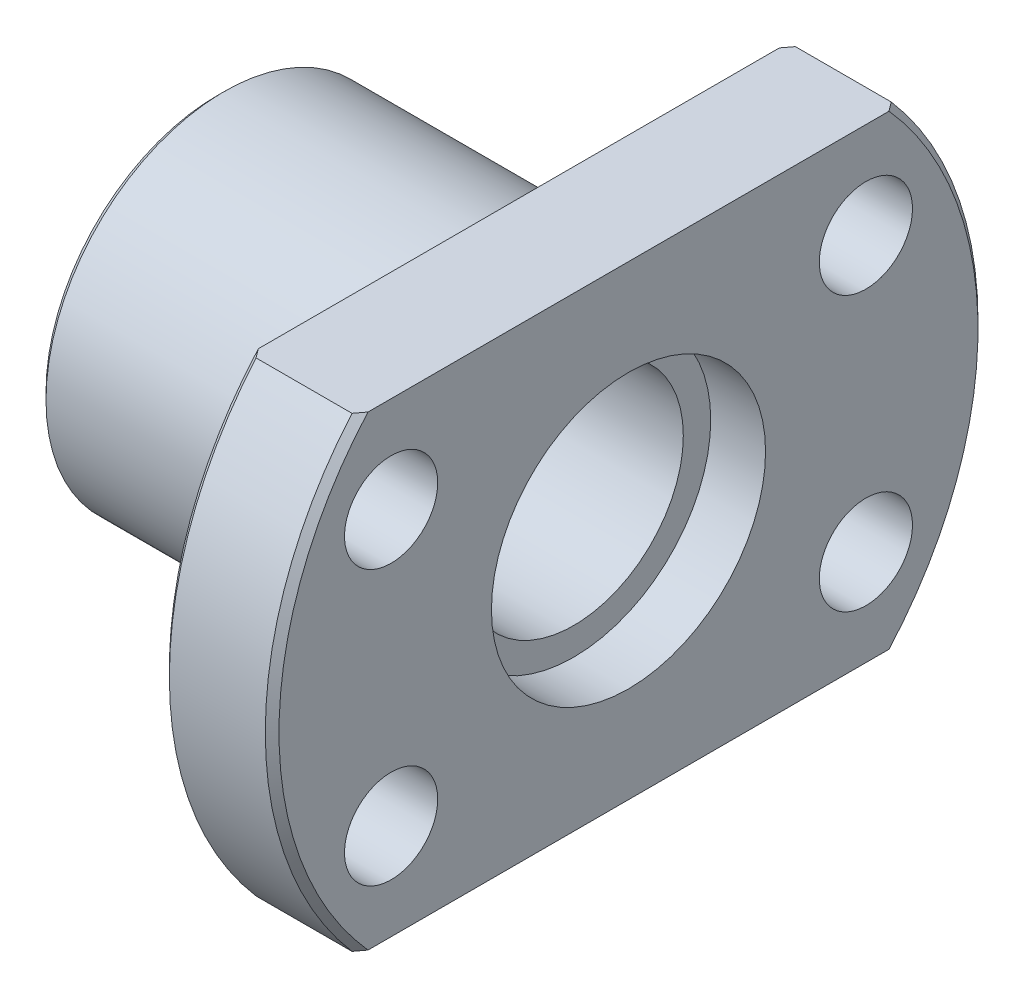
ISO-10303-21;
HEADER;
FILE_DESCRIPTION(('STEP AP214'),'2;1');
FILE_NAME('part.step','',(''),(''),'','','');
FILE_SCHEMA(('AUTOMOTIVE_DESIGN { 1 0 10303 214 1 1 1 1 }'));
ENDSEC;
DATA;
#1=APPLICATION_CONTEXT('core data for automotive mechanical design processes');
#2=APPLICATION_PROTOCOL_DEFINITION('international standard','automotive_design',2000,#1);
#3=PRODUCT_CONTEXT('',#1,'mechanical');
#4=PRODUCT('Part','Part','',(#3));
#5=PRODUCT_RELATED_PRODUCT_CATEGORY('part','',(#4));
#6=PRODUCT_DEFINITION_FORMATION('','',#4);
#7=PRODUCT_DEFINITION_CONTEXT('part definition',#1,'design');
#8=PRODUCT_DEFINITION('design','',#6,#7);
#9=PRODUCT_DEFINITION_SHAPE('','',#8);
#10=(LENGTH_UNIT() NAMED_UNIT(*) SI_UNIT(.MILLI.,.METRE.));
#11=(NAMED_UNIT(*) PLANE_ANGLE_UNIT() SI_UNIT($,.RADIAN.));
#12=(NAMED_UNIT(*) SI_UNIT($,.STERADIAN.) SOLID_ANGLE_UNIT());
#13=UNCERTAINTY_MEASURE_WITH_UNIT(LENGTH_MEASURE(1.E-05),#10,'distance_accuracy_value','');
#14=(GEOMETRIC_REPRESENTATION_CONTEXT(3) GLOBAL_UNCERTAINTY_ASSIGNED_CONTEXT((#13)) GLOBAL_UNIT_ASSIGNED_CONTEXT((#10,
#11,#12)) REPRESENTATION_CONTEXT('',''));
#15=CARTESIAN_POINT('',(0.,0.,0.));
#16=DIRECTION('',(0.,0.,1.));
#17=DIRECTION('',(1.,0.,0.));
#18=AXIS2_PLACEMENT_3D('',#15,#16,#17);
#19=CARTESIAN_POINT('',(11.,12.75,0.));
#20=DIRECTION('',(1.,0.,0.));
#21=DIRECTION('',(0.,0.,-1.));
#22=AXIS2_PLACEMENT_3D('',#19,#20,#21);
#23=PLANE('',#22);
#24=CARTESIAN_POINT('',(11.,5.00000000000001,8.6602540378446));
#25=DIRECTION('',(1.,0.,0.));
#26=DIRECTION('',(0.,0.,-1.));
#27=AXIS2_PLACEMENT_3D('',#24,#25,#26);
#28=CIRCLE('',#27,1.7);
#29=CARTESIAN_POINT('',(11.,5.00000000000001,6.9602540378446));
#30=VERTEX_POINT('',#29);
#31=EDGE_CURVE('E492',#30,#30,#28,.T.);
#32=ORIENTED_EDGE('',*,*,#31,.T.);
#33=EDGE_LOOP('',(#32));
#34=FACE_BOUND('',#33,.T.);
#35=CARTESIAN_POINT('',(11.,-5.00000000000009,8.66025403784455));
#36=DIRECTION('',(1.,0.,0.));
#37=DIRECTION('',(0.,0.,-1.));
#38=AXIS2_PLACEMENT_3D('',#35,#36,#37);
#39=CIRCLE('',#38,1.7);
#40=CARTESIAN_POINT('',(11.,-5.00000000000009,6.96025403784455));
#41=VERTEX_POINT('',#40);
#42=EDGE_CURVE('E488',#41,#41,#39,.T.);
#43=ORIENTED_EDGE('',*,*,#42,.T.);
#44=EDGE_LOOP('',(#43));
#45=FACE_BOUND('',#44,.T.);
#46=CARTESIAN_POINT('',(11.,-5.,-8.6602540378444));
#47=DIRECTION('',(1.,0.,0.));
#48=DIRECTION('',(0.,0.,-1.));
#49=AXIS2_PLACEMENT_3D('',#46,#47,#48);
#50=CIRCLE('',#49,1.7);
#51=CARTESIAN_POINT('',(11.,-5.,-10.3602540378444));
#52=VERTEX_POINT('',#51);
#53=EDGE_CURVE('E480',#52,#52,#50,.T.);
#54=ORIENTED_EDGE('',*,*,#53,.T.);
#55=EDGE_LOOP('',(#54));
#56=FACE_BOUND('',#55,.T.);
#57=CARTESIAN_POINT('',(11.,5.,-8.6602540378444));
#58=DIRECTION('',(1.,0.,0.));
#59=DIRECTION('',(0.,0.,-1.));
#60=AXIS2_PLACEMENT_3D('',#57,#58,#59);
#61=CIRCLE('',#60,1.7);
#62=CARTESIAN_POINT('',(11.,5.,-10.3602540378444));
#63=VERTEX_POINT('',#62);
#64=EDGE_CURVE('E174',#63,#63,#61,.T.);
#65=ORIENTED_EDGE('',*,*,#64,.T.);
#66=EDGE_LOOP('',(#65));
#67=FACE_BOUND('',#66,.T.);
#68=CARTESIAN_POINT('',(11.,0.,0.));
#69=DIRECTION('',(-1.,0.,0.));
#70=DIRECTION('',(0.,0.,1.));
#71=AXIS2_PLACEMENT_3D('',#68,#69,#70);
#72=CIRCLE('',#71,6.);
#73=CARTESIAN_POINT('',(11.,0.,6.));
#74=VERTEX_POINT('',#73);
#75=EDGE_CURVE('E131',#74,#74,#72,.T.);
#76=ORIENTED_EDGE('',*,*,#75,.F.);
#77=EDGE_LOOP('',(#76));
#78=FACE_BOUND('',#77,.T.);
#79=DIRECTION('',(0.,0.,1.));
#80=VECTOR('',#79,1.);
#81=CARTESIAN_POINT('',(11.,8.5,-13.1));
#82=LINE('',#81,#80);
#83=CARTESIAN_POINT('',(11.,8.5,-9.50328890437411));
#84=VERTEX_POINT('',#83);
#85=CARTESIAN_POINT('',(11.,8.5,9.5032889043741));
#86=VERTEX_POINT('',#85);
#87=EDGE_CURVE('E169',#84,#86,#82,.T.);
#88=ORIENTED_EDGE('',*,*,#87,.F.);
#89=CARTESIAN_POINT('',(11.,0.,0.));
#90=DIRECTION('',(-1.,0.,0.));
#91=DIRECTION('',(0.,0.,1.));
#92=AXIS2_PLACEMENT_3D('',#89,#90,#91);
#93=CIRCLE('',#92,12.75);
#94=CARTESIAN_POINT('',(11.,-8.5,-9.5032889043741));
#95=VERTEX_POINT('',#94);
#96=EDGE_CURVE('E130',#84,#95,#93,.T.);
#97=ORIENTED_EDGE('',*,*,#96,.T.);
#98=DIRECTION('',(0.,0.,-1.));
#99=VECTOR('',#98,1.);
#100=CARTESIAN_POINT('',(11.,-8.5,13.1));
#101=LINE('',#100,#99);
#102=CARTESIAN_POINT('',(11.,-8.5,9.50328890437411));
#103=VERTEX_POINT('',#102);
#104=EDGE_CURVE('E110',#103,#95,#101,.T.);
#105=ORIENTED_EDGE('',*,*,#104,.F.);
#106=EDGE_CURVE('E127',#103,#86,#93,.T.);
#107=ORIENTED_EDGE('',*,*,#106,.T.);
#108=EDGE_LOOP('',(#88,#97,#105,#107));
#109=FACE_BOUND('',#108,.T.);
#110=ADVANCED_FACE('F32',(#34,#45,#56,#67,#78,#109),#23,.F.);
#111=CARTESIAN_POINT('',(11.25,0.,0.));
#112=DIRECTION('',(1.,0.,0.));
#113=DIRECTION('',(0.,0.,-1.));
#114=AXIS2_PLACEMENT_3D('',#111,#112,#113);
#115=CONICAL_SURFACE('',#114,13.,0.785398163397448);
#116=CARTESIAN_POINT('',(26.8509211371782,8.5,-27.3086559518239));
#117=CARTESIAN_POINT('',(26.3806792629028,8.5,-26.8161444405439));
#118=CARTESIAN_POINT('',(25.9110077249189,8.5,-26.3230870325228));
#119=CARTESIAN_POINT('',(24.9730470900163,8.5,-25.3356529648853));
#120=CARTESIAN_POINT('',(24.5047580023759,8.5,-24.8412762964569));
#121=CARTESIAN_POINT('',(23.5696803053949,8.5,-23.8508451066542));
#122=CARTESIAN_POINT('',(23.1028921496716,8.5,-23.3547901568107));
#123=CARTESIAN_POINT('',(22.171274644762,8.5,-22.3608455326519));
#124=CARTESIAN_POINT('',(21.706445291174,8.5,-21.862955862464));
#125=CARTESIAN_POINT('',(20.7753991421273,8.5,-20.8609252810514));
#126=CARTESIAN_POINT('',(20.3092016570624,8.5,-20.3567664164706));
#127=CARTESIAN_POINT('',(19.3797732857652,8.5,-19.345721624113));
#128=CARTESIAN_POINT('',(18.9165423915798,8.5,-18.8388357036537));
#129=CARTESIAN_POINT('',(17.9938558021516,8.5,-17.8217737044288));
#130=CARTESIAN_POINT('',(17.53439955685,8.5,-17.3115981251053));
#131=CARTESIAN_POINT('',(16.6201982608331,8.5,-16.287043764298));
#132=CARTESIAN_POINT('',(16.1654531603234,8.5,-15.7726650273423));
#133=CARTESIAN_POINT('',(15.4399320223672,8.5,-14.9421199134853));
#134=CARTESIAN_POINT('',(15.1672153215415,8.5,-14.6276489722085));
#135=CARTESIAN_POINT('',(14.6244674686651,8.5,-13.9963993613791));
#136=CARTESIAN_POINT('',(14.3544362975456,8.5,-13.6796207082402));
#137=CARTESIAN_POINT('',(13.8175130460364,8.5,-13.0432604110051));
#138=CARTESIAN_POINT('',(13.5506218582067,8.5,-12.723678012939));
#139=CARTESIAN_POINT('',(13.0207389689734,8.5,-12.0812961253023));
#140=CARTESIAN_POINT('',(12.7577472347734,8.5,-11.758496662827));
#141=CARTESIAN_POINT('',(12.2370461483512,8.5,-11.1096744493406));
#142=CARTESIAN_POINT('',(11.97932763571,8.5,-10.7836590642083));
#143=CARTESIAN_POINT('',(11.4698057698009,8.5,-10.1270030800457));
#144=CARTESIAN_POINT('',(11.2180026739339,8.5,-9.79636228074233));
#145=CARTESIAN_POINT('',(10.7219968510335,8.5,-9.12964035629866));
#146=CARTESIAN_POINT('',(10.4777907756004,8.5,-8.79356173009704));
#147=CARTESIAN_POINT('',(9.99901158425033,8.5,-8.11463307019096));
#148=CARTESIAN_POINT('',(9.76443731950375,8.5,-7.77178385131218));
#149=CARTESIAN_POINT('',(9.34298572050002,8.5,-7.13114235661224));
#150=CARTESIAN_POINT('',(9.1543212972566,8.5,-6.83453017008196));
#151=CARTESIAN_POINT('',(8.78845116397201,8.5,-6.2342299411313));
#152=CARTESIAN_POINT('',(8.61124667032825,8.5,-5.93054115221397));
#153=CARTESIAN_POINT('',(8.27150637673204,8.5,-5.31475216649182));
#154=CARTESIAN_POINT('',(8.10897997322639,8.5,-5.00264674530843));
#155=CARTESIAN_POINT('',(7.80312610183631,8.5,-4.3691120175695));
#156=CARTESIAN_POINT('',(7.65979458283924,8.5,-4.04768469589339));
#157=CARTESIAN_POINT('',(7.42577714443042,8.5,-3.46414265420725));
#158=CARTESIAN_POINT('',(7.33037555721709,8.5,-3.20393104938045));
#159=CARTESIAN_POINT('',(7.1582443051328,8.5,-2.67743312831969));
#160=CARTESIAN_POINT('',(7.08150741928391,8.5,-2.41114920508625));
#161=CARTESIAN_POINT('',(6.9503059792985,8.5,-1.87423092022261));
#162=CARTESIAN_POINT('',(6.89575117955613,8.5,-1.60361893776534));
#163=CARTESIAN_POINT('',(6.8114280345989,8.5,-1.05852616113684));
#164=CARTESIAN_POINT('',(6.78165676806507,8.5,-0.78404582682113));
#165=CARTESIAN_POINT('',(6.74862071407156,8.5,-0.231018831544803));
#166=CARTESIAN_POINT('',(6.74559318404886,8.5,0.0475423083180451));
#167=CARTESIAN_POINT('',(6.76687244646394,8.5,0.603600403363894));
#168=CARTESIAN_POINT('',(6.79117973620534,8.5,0.881097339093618));
#169=CARTESIAN_POINT('',(6.86565657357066,8.5,1.43342924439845));
#170=CARTESIAN_POINT('',(6.91590714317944,8.5,1.70825311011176));
#171=CARTESIAN_POINT('',(7.03942590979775,8.5,2.25263719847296));
#172=CARTESIAN_POINT('',(7.11269950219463,8.5,2.52219617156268));
#173=CARTESIAN_POINT('',(7.32273745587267,8.5,3.19601127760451));
#174=CARTESIAN_POINT('',(7.47259310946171,8.5,3.59619208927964));
#175=CARTESIAN_POINT('',(7.72288719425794,8.5,4.18535880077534));
#176=CARTESIAN_POINT('',(7.8106194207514,8.5,4.37998930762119));
#177=CARTESIAN_POINT('',(7.99340153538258,8.5,4.76578704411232));
#178=CARTESIAN_POINT('',(8.08845080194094,8.5,4.95695456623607));
#179=CARTESIAN_POINT('',(8.28588531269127,8.5,5.33815297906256));
#180=CARTESIAN_POINT('',(8.38834064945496,8.5,5.52814731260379));
#181=CARTESIAN_POINT('',(8.59870227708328,8.5,5.90509054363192));
#182=CARTESIAN_POINT('',(8.70660864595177,8.5,6.09203939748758));
#183=CARTESIAN_POINT('',(8.92703619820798,8.5,6.46307686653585));
#184=CARTESIAN_POINT('',(9.03955532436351,8.5,6.64716670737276));
#185=CARTESIAN_POINT('',(9.26859196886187,8.5,7.01282188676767));
#186=CARTESIAN_POINT('',(9.38510926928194,8.5,7.19438736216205));
#187=CARTESIAN_POINT('',(9.66412984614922,8.5,7.62015294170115));
#188=CARTESIAN_POINT('',(9.82809921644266,8.5,7.86339179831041));
#189=CARTESIAN_POINT('',(10.1613073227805,8.5,8.3462417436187));
#190=CARTESIAN_POINT('',(10.3305463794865,8.5,8.58585261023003));
#191=CARTESIAN_POINT('',(10.6734460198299,8.5,9.06197001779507));
#192=CARTESIAN_POINT('',(10.8471076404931,8.5,9.29847581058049));
#193=CARTESIAN_POINT('',(11.1981194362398,8.5,9.7687375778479));
#194=CARTESIAN_POINT('',(11.3754697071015,8.5,10.0024934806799));
#195=CARTESIAN_POINT('',(11.9125167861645,8.5,10.7006149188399));
#196=CARTESIAN_POINT('',(12.2768851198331,8.5,11.1613878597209));
#197=CARTESIAN_POINT('',(13.0146617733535,8.5,12.0755046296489));
#198=CARTESIAN_POINT('',(13.3880690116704,8.5,12.5288493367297));
#199=CARTESIAN_POINT('',(14.1432170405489,8.5,13.4315188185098));
#200=CARTESIAN_POINT('',(14.5249844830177,8.5,13.880821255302));
#201=CARTESIAN_POINT('',(15.2938746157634,8.5,14.7748303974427));
#202=CARTESIAN_POINT('',(15.6809974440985,8.5,15.2195369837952));
#203=CARTESIAN_POINT('',(16.4592387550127,8.5,16.10499711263));
#204=CARTESIAN_POINT('',(16.8503548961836,8.5,16.5457527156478));
#205=CARTESIAN_POINT('',(17.6359605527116,8.5,17.4242364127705));
#206=CARTESIAN_POINT('',(18.0304500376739,8.5,17.8619645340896));
#207=CARTESIAN_POINT('',(19.1193520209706,8.5,19.0626321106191));
#208=CARTESIAN_POINT('',(19.81658812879,8.5,19.8230100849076));
#209=CARTESIAN_POINT('',(21.2171729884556,8.5,21.3383295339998));
#210=CARTESIAN_POINT('',(21.9205227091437,8.5,22.0932701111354));
#211=CARTESIAN_POINT('',(23.3265654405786,8.5,23.5934742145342));
#212=CARTESIAN_POINT('',(24.0292259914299,8.5,24.3387681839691));
#213=CARTESIAN_POINT('',(25.0856849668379,8.5,25.4542361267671));
#214=CARTESIAN_POINT('',(25.438216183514,8.5,25.8256119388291));
#215=CARTESIAN_POINT('',(26.1440290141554,8.5,26.5676484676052));
#216=CARTESIAN_POINT('',(26.4973106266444,8.5,26.9383091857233));
#217=CARTESIAN_POINT('',(26.8509211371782,8.5,27.3086559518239));
#218=B_SPLINE_CURVE_WITH_KNOTS('',3,(#116,#117,#118,#119,#120,#121,#122,#123,#124,#125,#126,
#127,#128,#129,#130,#131,#132,#133,#134,#135,#136,#137,#138,#139,#140,#141,#142,#143,#144,#145,
#146,#147,#148,#149,#150,#151,#152,#153,#154,#155,#156,#157,#158,#159,#160,#161,#162,#163,#164,
#165,#166,#167,#168,#169,#170,#171,#172,#173,#174,#175,#176,#177,#178,#179,#180,#181,#182,#183,
#184,#185,#186,#187,#188,#189,#190,#191,#192,#193,#194,#195,#196,#197,#198,#199,#200,#201,#202,
#203,#204,#205,#206,#207,#208,#209,#210,#211,#212,#213,#214,#215,#216,#217),.UNSPECIFIED.,.F.,
.F.,(4,2,2,2,2,2,2,2,2,2,2,2,2,2,2,2,2,2,2,2,2,2,2,2,2,2,2,2,2,2,2,2,2,2,2,2,2,2,2,2,2,2,2,2,2,
2,2,2,2,2,4),(0.,2.04285563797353,4.08572495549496,6.12916253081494,8.1725955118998,
10.2325973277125,12.2925936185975,14.3522841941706,16.4119529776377,17.6606993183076,
18.9094367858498,20.1585210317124,21.40759476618,22.6542738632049,23.9010071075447,
25.1471828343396,26.3932094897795,27.4475984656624,28.5020991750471,29.5572702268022,
30.6122182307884,31.443090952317,32.2736417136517,33.1007788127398,33.9278184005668,
34.7621877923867,35.5965723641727,36.4335786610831,37.2707812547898,38.5502873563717,
39.1906663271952,39.8309909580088,40.4784691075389,41.1259565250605,41.7731582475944,
42.4203247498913,43.30026980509,44.1802685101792,45.0604754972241,45.9407053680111,
47.7028203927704,49.4647256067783,51.233447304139,53.0022146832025,54.7699985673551,
56.5377665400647,59.6326816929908,62.7280965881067,65.800988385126,67.3371465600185,
68.8733017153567),.UNSPECIFIED.);
#219=CARTESIAN_POINT('',(11.25,8.5,-9.836157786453));
#220=VERTEX_POINT('',#219);
#221=EDGE_CURVE('E180',#220,#84,#218,.T.);
#222=ORIENTED_EDGE('',*,*,#221,.F.);
#223=CARTESIAN_POINT('',(11.25,0.,0.));
#224=DIRECTION('',(-1.,0.,0.));
#225=DIRECTION('',(0.,0.,1.));
#226=AXIS2_PLACEMENT_3D('',#223,#224,#225);
#227=CIRCLE('',#226,13.);
#228=CARTESIAN_POINT('',(11.25,-8.5,-9.836157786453));
#229=VERTEX_POINT('',#228);
#230=EDGE_CURVE('E126',#220,#229,#227,.T.);
#231=ORIENTED_EDGE('',*,*,#230,.T.);
#232=CARTESIAN_POINT('',(26.8509211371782,-8.5,27.3086559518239));
#233=CARTESIAN_POINT('',(26.3806792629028,-8.5,26.8161444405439));
#234=CARTESIAN_POINT('',(25.9110077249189,-8.5,26.3230870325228));
#235=CARTESIAN_POINT('',(24.9730470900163,-8.5,25.3356529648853));
#236=CARTESIAN_POINT('',(24.5047580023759,-8.5,24.8412762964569));
#237=CARTESIAN_POINT('',(23.5696803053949,-8.5,23.8508451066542));
#238=CARTESIAN_POINT('',(23.1028921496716,-8.5,23.3547901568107));
#239=CARTESIAN_POINT('',(22.171274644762,-8.5,22.3608455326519));
#240=CARTESIAN_POINT('',(21.706445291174,-8.5,21.862955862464));
#241=CARTESIAN_POINT('',(20.7753991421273,-8.5,20.8609252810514));
#242=CARTESIAN_POINT('',(20.3092016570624,-8.5,20.3567664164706));
#243=CARTESIAN_POINT('',(19.3797732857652,-8.5,19.345721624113));
#244=CARTESIAN_POINT('',(18.9165423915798,-8.5,18.8388357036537));
#245=CARTESIAN_POINT('',(17.9938558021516,-8.5,17.8217737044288));
#246=CARTESIAN_POINT('',(17.53439955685,-8.5,17.3115981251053));
#247=CARTESIAN_POINT('',(16.6201982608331,-8.5,16.287043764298));
#248=CARTESIAN_POINT('',(16.1654531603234,-8.5,15.7726650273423));
#249=CARTESIAN_POINT('',(15.4399320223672,-8.5,14.9421199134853));
#250=CARTESIAN_POINT('',(15.1672153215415,-8.5,14.6276489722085));
#251=CARTESIAN_POINT('',(14.6244674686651,-8.5,13.9963993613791));
#252=CARTESIAN_POINT('',(14.3544362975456,-8.5,13.6796207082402));
#253=CARTESIAN_POINT('',(13.8175130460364,-8.5,13.0432604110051));
#254=CARTESIAN_POINT('',(13.5506218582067,-8.5,12.723678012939));
#255=CARTESIAN_POINT('',(13.0207389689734,-8.5,12.0812961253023));
#256=CARTESIAN_POINT('',(12.7577472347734,-8.5,11.758496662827));
#257=CARTESIAN_POINT('',(12.2370461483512,-8.5,11.1096744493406));
#258=CARTESIAN_POINT('',(11.97932763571,-8.5,10.7836590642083));
#259=CARTESIAN_POINT('',(11.4698057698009,-8.5,10.1270030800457));
#260=CARTESIAN_POINT('',(11.2180026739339,-8.5,9.79636228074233));
#261=CARTESIAN_POINT('',(10.7219968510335,-8.5,9.12964035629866));
#262=CARTESIAN_POINT('',(10.4777907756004,-8.5,8.79356173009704));
#263=CARTESIAN_POINT('',(9.99901158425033,-8.5,8.11463307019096));
#264=CARTESIAN_POINT('',(9.76443731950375,-8.5,7.77178385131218));
#265=CARTESIAN_POINT('',(9.34298572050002,-8.5,7.13114235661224));
#266=CARTESIAN_POINT('',(9.1543212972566,-8.5,6.83453017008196));
#267=CARTESIAN_POINT('',(8.78845116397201,-8.5,6.2342299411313));
#268=CARTESIAN_POINT('',(8.61124667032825,-8.5,5.93054115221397));
#269=CARTESIAN_POINT('',(8.27150637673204,-8.5,5.31475216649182));
#270=CARTESIAN_POINT('',(8.10897997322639,-8.5,5.00264674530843));
#271=CARTESIAN_POINT('',(7.80312610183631,-8.5,4.3691120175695));
#272=CARTESIAN_POINT('',(7.65979458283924,-8.5,4.04768469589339));
#273=CARTESIAN_POINT('',(7.42577714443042,-8.5,3.46414265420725));
#274=CARTESIAN_POINT('',(7.33037555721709,-8.5,3.20393104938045));
#275=CARTESIAN_POINT('',(7.1582443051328,-8.5,2.67743312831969));
#276=CARTESIAN_POINT('',(7.08150741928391,-8.5,2.41114920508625));
#277=CARTESIAN_POINT('',(6.9503059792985,-8.5,1.87423092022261));
#278=CARTESIAN_POINT('',(6.89575117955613,-8.5,1.60361893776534));
#279=CARTESIAN_POINT('',(6.8114280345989,-8.5,1.05852616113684));
#280=CARTESIAN_POINT('',(6.78165676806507,-8.5,0.78404582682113));
#281=CARTESIAN_POINT('',(6.74862071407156,-8.5,0.231018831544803));
#282=CARTESIAN_POINT('',(6.74559318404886,-8.5,-0.0475423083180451));
#283=CARTESIAN_POINT('',(6.76687244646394,-8.5,-0.603600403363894));
#284=CARTESIAN_POINT('',(6.79117973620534,-8.5,-0.881097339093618));
#285=CARTESIAN_POINT('',(6.86565657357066,-8.5,-1.43342924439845));
#286=CARTESIAN_POINT('',(6.91590714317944,-8.5,-1.70825311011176));
#287=CARTESIAN_POINT('',(7.03942590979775,-8.5,-2.25263719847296));
#288=CARTESIAN_POINT('',(7.11269950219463,-8.5,-2.52219617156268));
#289=CARTESIAN_POINT('',(7.32273745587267,-8.5,-3.19601127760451));
#290=CARTESIAN_POINT('',(7.47259310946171,-8.5,-3.59619208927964));
#291=CARTESIAN_POINT('',(7.72288719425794,-8.5,-4.18535880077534));
#292=CARTESIAN_POINT('',(7.8106194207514,-8.5,-4.37998930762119));
#293=CARTESIAN_POINT('',(7.99340153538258,-8.5,-4.76578704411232));
#294=CARTESIAN_POINT('',(8.08845080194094,-8.5,-4.95695456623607));
#295=CARTESIAN_POINT('',(8.28588531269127,-8.5,-5.33815297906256));
#296=CARTESIAN_POINT('',(8.38834064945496,-8.5,-5.52814731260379));
#297=CARTESIAN_POINT('',(8.59870227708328,-8.5,-5.90509054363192));
#298=CARTESIAN_POINT('',(8.70660864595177,-8.5,-6.09203939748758));
#299=CARTESIAN_POINT('',(8.92703619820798,-8.5,-6.46307686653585));
#300=CARTESIAN_POINT('',(9.03955532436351,-8.5,-6.64716670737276));
#301=CARTESIAN_POINT('',(9.26859196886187,-8.5,-7.01282188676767));
#302=CARTESIAN_POINT('',(9.38510926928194,-8.5,-7.19438736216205));
#303=CARTESIAN_POINT('',(9.66412984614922,-8.5,-7.62015294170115));
#304=CARTESIAN_POINT('',(9.82809921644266,-8.5,-7.86339179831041));
#305=CARTESIAN_POINT('',(10.1613073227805,-8.5,-8.3462417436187));
#306=CARTESIAN_POINT('',(10.3305463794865,-8.5,-8.58585261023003));
#307=CARTESIAN_POINT('',(10.6734460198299,-8.5,-9.06197001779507));
#308=CARTESIAN_POINT('',(10.8471076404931,-8.5,-9.29847581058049));
#309=CARTESIAN_POINT('',(11.1981194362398,-8.5,-9.7687375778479));
#310=CARTESIAN_POINT('',(11.3754697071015,-8.5,-10.0024934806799));
#311=CARTESIAN_POINT('',(11.9125167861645,-8.5,-10.7006149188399));
#312=CARTESIAN_POINT('',(12.2768851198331,-8.5,-11.1613878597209));
#313=CARTESIAN_POINT('',(13.0146617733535,-8.5,-12.0755046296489));
#314=CARTESIAN_POINT('',(13.3880690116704,-8.5,-12.5288493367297));
#315=CARTESIAN_POINT('',(14.1432170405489,-8.5,-13.4315188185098));
#316=CARTESIAN_POINT('',(14.5249844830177,-8.5,-13.880821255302));
#317=CARTESIAN_POINT('',(15.2938746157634,-8.5,-14.7748303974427));
#318=CARTESIAN_POINT('',(15.6809974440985,-8.5,-15.2195369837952));
#319=CARTESIAN_POINT('',(16.4592387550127,-8.5,-16.10499711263));
#320=CARTESIAN_POINT('',(16.8503548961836,-8.5,-16.5457527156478));
#321=CARTESIAN_POINT('',(17.6359605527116,-8.5,-17.4242364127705));
#322=CARTESIAN_POINT('',(18.0304500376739,-8.5,-17.8619645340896));
#323=CARTESIAN_POINT('',(19.1193520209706,-8.5,-19.0626321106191));
#324=CARTESIAN_POINT('',(19.81658812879,-8.5,-19.8230100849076));
#325=CARTESIAN_POINT('',(21.2171729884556,-8.5,-21.3383295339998));
#326=CARTESIAN_POINT('',(21.9205227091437,-8.5,-22.0932701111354));
#327=CARTESIAN_POINT('',(23.3265654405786,-8.5,-23.5934742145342));
#328=CARTESIAN_POINT('',(24.0292259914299,-8.5,-24.3387681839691));
#329=CARTESIAN_POINT('',(25.0856849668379,-8.5,-25.4542361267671));
#330=CARTESIAN_POINT('',(25.438216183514,-8.5,-25.8256119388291));
#331=CARTESIAN_POINT('',(26.1440290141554,-8.5,-26.5676484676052));
#332=CARTESIAN_POINT('',(26.4973106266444,-8.5,-26.9383091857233));
#333=CARTESIAN_POINT('',(26.8509211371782,-8.5,-27.3086559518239));
#334=B_SPLINE_CURVE_WITH_KNOTS('',3,(#232,#233,#234,#235,#236,#237,#238,#239,#240,#241,#242,
#243,#244,#245,#246,#247,#248,#249,#250,#251,#252,#253,#254,#255,#256,#257,#258,#259,#260,#261,
#262,#263,#264,#265,#266,#267,#268,#269,#270,#271,#272,#273,#274,#275,#276,#277,#278,#279,#280,
#281,#282,#283,#284,#285,#286,#287,#288,#289,#290,#291,#292,#293,#294,#295,#296,#297,#298,#299,
#300,#301,#302,#303,#304,#305,#306,#307,#308,#309,#310,#311,#312,#313,#314,#315,#316,#317,#318,
#319,#320,#321,#322,#323,#324,#325,#326,#327,#328,#329,#330,#331,#332,#333),.UNSPECIFIED.,.F.,
.F.,(4,2,2,2,2,2,2,2,2,2,2,2,2,2,2,2,2,2,2,2,2,2,2,2,2,2,2,2,2,2,2,2,2,2,2,2,2,2,2,2,2,2,2,2,2,
2,2,2,2,2,4),(0.,2.04285563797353,4.08572495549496,6.12916253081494,8.1725955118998,
10.2325973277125,12.2925936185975,14.3522841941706,16.4119529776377,17.6606993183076,
18.9094367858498,20.1585210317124,21.40759476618,22.6542738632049,23.9010071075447,
25.1471828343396,26.3932094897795,27.4475984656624,28.5020991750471,29.5572702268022,
30.6122182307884,31.443090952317,32.2736417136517,33.1007788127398,33.9278184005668,
34.7621877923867,35.5965723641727,36.4335786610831,37.2707812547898,38.5502873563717,
39.1906663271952,39.8309909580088,40.4784691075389,41.1259565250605,41.7731582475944,
42.4203247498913,43.30026980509,44.1802685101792,45.0604754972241,45.9407053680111,
47.7028203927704,49.4647256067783,51.233447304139,53.0022146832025,54.7699985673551,
56.5377665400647,59.6326816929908,62.7280965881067,65.800988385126,67.3371465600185,
68.8733017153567),.UNSPECIFIED.);
#335=EDGE_CURVE('E182',#95,#229,#334,.T.);
#336=ORIENTED_EDGE('',*,*,#335,.F.);
#337=ORIENTED_EDGE('',*,*,#96,.F.);
#338=EDGE_LOOP('',(#222,#231,#336,#337));
#339=FACE_BOUND('',#338,.T.);
#340=ADVANCED_FACE('F164',(#339),#115,.T.);
#341=CARTESIAN_POINT('',(11.25,8.5,9.836157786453));
#342=VERTEX_POINT('',#341);
#343=EDGE_CURVE('E229',#86,#342,#218,.T.);
#344=ORIENTED_EDGE('',*,*,#343,.F.);
#345=ORIENTED_EDGE('',*,*,#106,.F.);
#346=CARTESIAN_POINT('',(11.25,-8.5,9.836157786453));
#347=VERTEX_POINT('',#346);
#348=EDGE_CURVE('E187',#347,#103,#334,.T.);
#349=ORIENTED_EDGE('',*,*,#348,.F.);
#350=EDGE_CURVE('E123',#347,#342,#227,.T.);
#351=ORIENTED_EDGE('',*,*,#350,.T.);
#352=EDGE_LOOP('',(#344,#345,#349,#351));
#353=FACE_BOUND('',#352,.T.);
#354=ADVANCED_FACE('F234',(#353),#115,.T.);
#355=CARTESIAN_POINT('',(15.,0.,0.));
#356=DIRECTION('',(-1.,0.,0.));
#357=DIRECTION('',(0.,0.,1.));
#358=AXIS2_PLACEMENT_3D('',#355,#356,#357);
#359=CYLINDRICAL_SURFACE('',#358,13.);
#360=DIRECTION('',(-1.,0.,0.));
#361=VECTOR('',#360,1.);
#362=CARTESIAN_POINT('',(15.,8.5,-9.836157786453));
#363=LINE('',#362,#361);
#364=CARTESIAN_POINT('',(14.75,8.5,-9.836157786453));
#365=VERTEX_POINT('',#364);
#366=EDGE_CURVE('E188',#365,#220,#363,.T.);
#367=ORIENTED_EDGE('',*,*,#366,.F.);
#368=CARTESIAN_POINT('',(14.75,0.,0.));
#369=DIRECTION('',(-1.,0.,0.));
#370=DIRECTION('',(0.,0.,1.));
#371=AXIS2_PLACEMENT_3D('',#368,#369,#370);
#372=CIRCLE('',#371,13.);
#373=CARTESIAN_POINT('',(14.75,-8.5,-9.836157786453));
#374=VERTEX_POINT('',#373);
#375=EDGE_CURVE('E122',#365,#374,#372,.T.);
#376=ORIENTED_EDGE('',*,*,#375,.T.);
#377=DIRECTION('',(-1.,0.,0.));
#378=VECTOR('',#377,1.);
#379=CARTESIAN_POINT('',(15.,-8.5,-9.836157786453));
#380=LINE('',#379,#378);
#381=EDGE_CURVE('E185',#229,#374,#380,.F.);
#382=ORIENTED_EDGE('',*,*,#381,.F.);
#383=ORIENTED_EDGE('',*,*,#230,.F.);
#384=EDGE_LOOP('',(#367,#376,#382,#383));
#385=FACE_BOUND('',#384,.T.);
#386=ADVANCED_FACE('F235',(#385),#359,.T.);
#387=DIRECTION('',(-1.,0.,0.));
#388=VECTOR('',#387,1.);
#389=CARTESIAN_POINT('',(15.,8.5,9.836157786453));
#390=LINE('',#389,#388);
#391=CARTESIAN_POINT('',(14.75,8.5,9.836157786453));
#392=VERTEX_POINT('',#391);
#393=EDGE_CURVE('E230',#342,#392,#390,.F.);
#394=ORIENTED_EDGE('',*,*,#393,.F.);
#395=ORIENTED_EDGE('',*,*,#350,.F.);
#396=DIRECTION('',(-1.,0.,0.));
#397=VECTOR('',#396,1.);
#398=CARTESIAN_POINT('',(15.,-8.5,9.836157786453));
#399=LINE('',#398,#397);
#400=CARTESIAN_POINT('',(14.75,-8.5,9.836157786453));
#401=VERTEX_POINT('',#400);
#402=EDGE_CURVE('E109',#401,#347,#399,.T.);
#403=ORIENTED_EDGE('',*,*,#402,.F.);
#404=EDGE_CURVE('E108',#401,#392,#372,.T.);
#405=ORIENTED_EDGE('',*,*,#404,.T.);
#406=EDGE_LOOP('',(#394,#395,#403,#405));
#407=FACE_BOUND('',#406,.T.);
#408=ADVANCED_FACE('F238',(#407),#359,.T.);
#409=CARTESIAN_POINT('',(15.,0.,0.));
#410=DIRECTION('',(-1.,0.,0.));
#411=DIRECTION('',(0.,0.,1.));
#412=AXIS2_PLACEMENT_3D('',#409,#410,#411);
#413=CONICAL_SURFACE('',#412,12.75,0.785398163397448);
#414=CARTESIAN_POINT('',(-0.850921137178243,8.5,27.3086559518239));
#415=CARTESIAN_POINT('',(-0.380679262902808,8.5,26.8161444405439));
#416=CARTESIAN_POINT('',(0.0889922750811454,8.5,26.3230870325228));
#417=CARTESIAN_POINT('',(1.02695290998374,8.5,25.3356529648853));
#418=CARTESIAN_POINT('',(1.49524199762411,8.5,24.8412762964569));
#419=CARTESIAN_POINT('',(2.43031969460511,8.5,23.8508451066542));
#420=CARTESIAN_POINT('',(2.89710785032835,8.5,23.3547901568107));
#421=CARTESIAN_POINT('',(3.82872535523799,8.5,22.3608455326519));
#422=CARTESIAN_POINT('',(4.29355470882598,8.5,21.862955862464));
#423=CARTESIAN_POINT('',(5.22460085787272,8.5,20.8609252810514));
#424=CARTESIAN_POINT('',(5.69079834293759,8.5,20.3567664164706));
#425=CARTESIAN_POINT('',(6.62022671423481,8.5,19.345721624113));
#426=CARTESIAN_POINT('',(7.08345760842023,8.5,18.8388357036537));
#427=CARTESIAN_POINT('',(8.00614419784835,8.5,17.8217737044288));
#428=CARTESIAN_POINT('',(8.46560044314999,8.5,17.3115981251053));
#429=CARTESIAN_POINT('',(9.37980173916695,8.5,16.287043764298));
#430=CARTESIAN_POINT('',(9.83454683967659,8.5,15.7726650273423));
#431=CARTESIAN_POINT('',(10.5600679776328,8.5,14.9421199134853));
#432=CARTESIAN_POINT('',(10.8327846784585,8.5,14.6276489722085));
#433=CARTESIAN_POINT('',(11.3755325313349,8.5,13.9963993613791));
#434=CARTESIAN_POINT('',(11.6455637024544,8.5,13.6796207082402));
#435=CARTESIAN_POINT('',(12.1824869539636,8.5,13.0432604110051));
#436=CARTESIAN_POINT('',(12.4493781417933,8.5,12.723678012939));
#437=CARTESIAN_POINT('',(12.9792610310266,8.5,12.0812961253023));
#438=CARTESIAN_POINT('',(13.2422527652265,8.5,11.758496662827));
#439=CARTESIAN_POINT('',(13.7629538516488,8.5,11.1096744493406));
#440=CARTESIAN_POINT('',(14.02067236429,8.5,10.7836590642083));
#441=CARTESIAN_POINT('',(14.5301942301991,8.5,10.1270030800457));
#442=CARTESIAN_POINT('',(14.7819973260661,8.5,9.79636228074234));
#443=CARTESIAN_POINT('',(15.2780031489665,8.5,9.12964035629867));
#444=CARTESIAN_POINT('',(15.5222092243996,8.5,8.79356173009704));
#445=CARTESIAN_POINT('',(16.0009884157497,8.5,8.11463307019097));
#446=CARTESIAN_POINT('',(16.2355626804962,8.5,7.77178385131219));
#447=CARTESIAN_POINT('',(16.6570142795,8.5,7.13114235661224));
#448=CARTESIAN_POINT('',(16.8456787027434,8.5,6.83453017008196));
#449=CARTESIAN_POINT('',(17.211548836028,8.5,6.2342299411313));
#450=CARTESIAN_POINT('',(17.3887533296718,8.5,5.93054115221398));
#451=CARTESIAN_POINT('',(17.728493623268,8.5,5.31475216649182));
#452=CARTESIAN_POINT('',(17.8910200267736,8.5,5.00264674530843));
#453=CARTESIAN_POINT('',(18.1968738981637,8.5,4.36911201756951));
#454=CARTESIAN_POINT('',(18.3402054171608,8.5,4.04768469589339));
#455=CARTESIAN_POINT('',(18.5742228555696,8.5,3.46414265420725));
#456=CARTESIAN_POINT('',(18.6696244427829,8.5,3.20393104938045));
#457=CARTESIAN_POINT('',(18.8417556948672,8.5,2.67743312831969));
#458=CARTESIAN_POINT('',(18.9184925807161,8.5,2.41114920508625));
#459=CARTESIAN_POINT('',(19.0496940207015,8.5,1.87423092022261));
#460=CARTESIAN_POINT('',(19.1042488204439,8.5,1.60361893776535));
#461=CARTESIAN_POINT('',(19.1885719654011,8.5,1.05852616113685));
#462=CARTESIAN_POINT('',(19.2183432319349,8.5,0.784045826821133));
#463=CARTESIAN_POINT('',(19.2513792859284,8.5,0.231018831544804));
#464=CARTESIAN_POINT('',(19.2544068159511,8.5,-0.0475423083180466));
#465=CARTESIAN_POINT('',(19.2331275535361,8.5,-0.603600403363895));
#466=CARTESIAN_POINT('',(19.2088202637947,8.5,-0.881097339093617));
#467=CARTESIAN_POINT('',(19.1343434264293,8.5,-1.43342924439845));
#468=CARTESIAN_POINT('',(19.0840928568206,8.5,-1.70825311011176));
#469=CARTESIAN_POINT('',(18.9605740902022,8.5,-2.25263719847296));
#470=CARTESIAN_POINT('',(18.8873004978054,8.5,-2.52219617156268));
#471=CARTESIAN_POINT('',(18.6772625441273,8.5,-3.19601127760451));
#472=CARTESIAN_POINT('',(18.5274068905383,8.5,-3.59619208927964));
#473=CARTESIAN_POINT('',(18.2771128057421,8.5,-4.18535880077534));
#474=CARTESIAN_POINT('',(18.1893805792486,8.5,-4.37998930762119));
#475=CARTESIAN_POINT('',(18.0065984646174,8.5,-4.76578704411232));
#476=CARTESIAN_POINT('',(17.9115491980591,8.5,-4.95695456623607));
#477=CARTESIAN_POINT('',(17.7141146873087,8.5,-5.33815297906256));
#478=CARTESIAN_POINT('',(17.611659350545,8.5,-5.52814731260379));
#479=CARTESIAN_POINT('',(17.4012977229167,8.5,-5.90509054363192));
#480=CARTESIAN_POINT('',(17.2933913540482,8.5,-6.09203939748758));
#481=CARTESIAN_POINT('',(17.072963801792,8.5,-6.46307686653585));
#482=CARTESIAN_POINT('',(16.9604446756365,8.5,-6.64716670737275));
#483=CARTESIAN_POINT('',(16.7314080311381,8.5,-7.01282188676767));
#484=CARTESIAN_POINT('',(16.6148907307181,8.5,-7.19438736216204));
#485=CARTESIAN_POINT('',(16.3358701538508,8.5,-7.62015294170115));
#486=CARTESIAN_POINT('',(16.1719007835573,8.5,-7.8633917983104));
#487=CARTESIAN_POINT('',(15.8386926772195,8.5,-8.3462417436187));
#488=CARTESIAN_POINT('',(15.6694536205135,8.5,-8.58585261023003));
#489=CARTESIAN_POINT('',(15.3265539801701,8.5,-9.06197001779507));
#490=CARTESIAN_POINT('',(15.1528923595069,8.5,-9.29847581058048));
#491=CARTESIAN_POINT('',(14.8018805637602,8.5,-9.7687375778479));
#492=CARTESIAN_POINT('',(14.6245302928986,8.5,-10.0024934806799));
#493=CARTESIAN_POINT('',(14.0874832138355,8.5,-10.7006149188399));
#494=CARTESIAN_POINT('',(13.7231148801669,8.5,-11.1613878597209));
#495=CARTESIAN_POINT('',(12.9853382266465,8.5,-12.0755046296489));
#496=CARTESIAN_POINT('',(12.6119309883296,8.5,-12.5288493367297));
#497=CARTESIAN_POINT('',(11.8567829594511,8.5,-13.4315188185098));
#498=CARTESIAN_POINT('',(11.4750155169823,8.5,-13.880821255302));
#499=CARTESIAN_POINT('',(10.7061253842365,8.5,-14.7748303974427));
#500=CARTESIAN_POINT('',(10.3190025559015,8.5,-15.2195369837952));
#501=CARTESIAN_POINT('',(9.54076124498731,8.5,-16.10499711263));
#502=CARTESIAN_POINT('',(9.14964510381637,8.5,-16.5457527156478));
#503=CARTESIAN_POINT('',(8.36403944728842,8.5,-17.4242364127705));
#504=CARTESIAN_POINT('',(7.96954996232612,8.5,-17.8619645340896));
#505=CARTESIAN_POINT('',(6.8806479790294,8.5,-19.0626321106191));
#506=CARTESIAN_POINT('',(6.18341187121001,8.5,-19.8230100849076));
#507=CARTESIAN_POINT('',(4.78282701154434,8.5,-21.3383295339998));
#508=CARTESIAN_POINT('',(4.07947729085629,8.5,-22.0932701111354));
#509=CARTESIAN_POINT('',(2.67343455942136,8.5,-23.5934742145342));
#510=CARTESIAN_POINT('',(1.97077400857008,8.5,-24.3387681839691));
#511=CARTESIAN_POINT('',(0.914315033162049,8.5,-25.4542361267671));
#512=CARTESIAN_POINT('',(0.561783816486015,8.5,-25.8256119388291));
#513=CARTESIAN_POINT('',(-0.144029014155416,8.5,-26.5676484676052));
#514=CARTESIAN_POINT('',(-0.497310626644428,8.5,-26.9383091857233));
#515=CARTESIAN_POINT('',(-0.850921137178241,8.5,-27.3086559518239));
#516=B_SPLINE_CURVE_WITH_KNOTS('',3,(#414,#415,#416,#417,#418,#419,#420,#421,#422,#423,#424,
#425,#426,#427,#428,#429,#430,#431,#432,#433,#434,#435,#436,#437,#438,#439,#440,#441,#442,#443,
#444,#445,#446,#447,#448,#449,#450,#451,#452,#453,#454,#455,#456,#457,#458,#459,#460,#461,#462,
#463,#464,#465,#466,#467,#468,#469,#470,#471,#472,#473,#474,#475,#476,#477,#478,#479,#480,#481,
#482,#483,#484,#485,#486,#487,#488,#489,#490,#491,#492,#493,#494,#495,#496,#497,#498,#499,#500,
#501,#502,#503,#504,#505,#506,#507,#508,#509,#510,#511,#512,#513,#514,#515),.UNSPECIFIED.,.F.,
.F.,(4,2,2,2,2,2,2,2,2,2,2,2,2,2,2,2,2,2,2,2,2,2,2,2,2,2,2,2,2,2,2,2,2,2,2,2,2,2,2,2,2,2,2,2,2,
2,2,2,2,2,4),(0.,2.04285563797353,4.08572495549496,6.12916253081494,8.1725955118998,
10.2325973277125,12.2925936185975,14.3522841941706,16.4119529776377,17.6606993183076,
18.9094367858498,20.1585210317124,21.40759476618,22.6542738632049,23.9010071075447,
25.1471828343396,26.3932094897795,27.4475984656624,28.5020991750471,29.5572702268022,
30.6122182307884,31.4430909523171,32.2736417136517,33.1007788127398,33.9278184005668,
34.7621877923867,35.5965723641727,36.4335786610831,37.2707812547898,38.5502873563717,
39.1906663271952,39.8309909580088,40.4784691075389,41.1259565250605,41.7731582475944,
42.4203247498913,43.30026980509,44.1802685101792,45.0604754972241,45.9407053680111,
47.7028203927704,49.4647256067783,51.233447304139,53.0022146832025,54.7699985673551,
56.5377665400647,59.6326816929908,62.7280965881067,65.800988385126,67.3371465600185,
68.8733017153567),.UNSPECIFIED.);
#517=CARTESIAN_POINT('',(15.,8.5,9.5032889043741));
#518=VERTEX_POINT('',#517);
#519=EDGE_CURVE('E54',#392,#518,#516,.T.);
#520=ORIENTED_EDGE('',*,*,#519,.F.);
#521=ORIENTED_EDGE('',*,*,#404,.F.);
#522=CARTESIAN_POINT('',(-0.850921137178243,-8.5,-27.3086559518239));
#523=CARTESIAN_POINT('',(-0.38067926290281,-8.5,-26.8161444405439));
#524=CARTESIAN_POINT('',(0.0889922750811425,-8.5,-26.3230870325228));
#525=CARTESIAN_POINT('',(1.02695290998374,-8.5,-25.3356529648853));
#526=CARTESIAN_POINT('',(1.4952419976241,-8.5,-24.8412762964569));
#527=CARTESIAN_POINT('',(2.43031969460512,-8.5,-23.8508451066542));
#528=CARTESIAN_POINT('',(2.89710785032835,-8.5,-23.3547901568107));
#529=CARTESIAN_POINT('',(3.82872535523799,-8.5,-22.3608455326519));
#530=CARTESIAN_POINT('',(4.29355470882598,-8.5,-21.862955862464));
#531=CARTESIAN_POINT('',(5.22460085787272,-8.5,-20.8609252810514));
#532=CARTESIAN_POINT('',(5.69079834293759,-8.5,-20.3567664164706));
#533=CARTESIAN_POINT('',(6.62022671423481,-8.5,-19.345721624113));
#534=CARTESIAN_POINT('',(7.08345760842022,-8.5,-18.8388357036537));
#535=CARTESIAN_POINT('',(8.00614419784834,-8.5,-17.8217737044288));
#536=CARTESIAN_POINT('',(8.46560044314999,-8.5,-17.3115981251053));
#537=CARTESIAN_POINT('',(9.37980173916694,-8.5,-16.287043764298));
#538=CARTESIAN_POINT('',(9.83454683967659,-8.5,-15.7726650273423));
#539=CARTESIAN_POINT('',(10.5600679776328,-8.5,-14.9421199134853));
#540=CARTESIAN_POINT('',(10.8327846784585,-8.5,-14.6276489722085));
#541=CARTESIAN_POINT('',(11.3755325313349,-8.5,-13.9963993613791));
#542=CARTESIAN_POINT('',(11.6455637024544,-8.5,-13.6796207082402));
#543=CARTESIAN_POINT('',(12.1824869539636,-8.5,-13.0432604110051));
#544=CARTESIAN_POINT('',(12.4493781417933,-8.5,-12.723678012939));
#545=CARTESIAN_POINT('',(12.9792610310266,-8.5,-12.0812961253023));
#546=CARTESIAN_POINT('',(13.2422527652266,-8.5,-11.758496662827));
#547=CARTESIAN_POINT('',(13.7629538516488,-8.5,-11.1096744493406));
#548=CARTESIAN_POINT('',(14.02067236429,-8.5,-10.7836590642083));
#549=CARTESIAN_POINT('',(14.5301942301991,-8.5,-10.1270030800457));
#550=CARTESIAN_POINT('',(14.7819973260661,-8.5,-9.79636228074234));
#551=CARTESIAN_POINT('',(15.2780031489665,-8.5,-9.12964035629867));
#552=CARTESIAN_POINT('',(15.5222092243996,-8.5,-8.79356173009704));
#553=CARTESIAN_POINT('',(16.0009884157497,-8.5,-8.11463307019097));
#554=CARTESIAN_POINT('',(16.2355626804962,-8.5,-7.77178385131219));
#555=CARTESIAN_POINT('',(16.6570142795,-8.5,-7.13114235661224));
#556=CARTESIAN_POINT('',(16.8456787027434,-8.5,-6.83453017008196));
#557=CARTESIAN_POINT('',(17.211548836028,-8.5,-6.2342299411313));
#558=CARTESIAN_POINT('',(17.3887533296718,-8.5,-5.93054115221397));
#559=CARTESIAN_POINT('',(17.728493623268,-8.5,-5.31475216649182));
#560=CARTESIAN_POINT('',(17.8910200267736,-8.5,-5.00264674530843));
#561=CARTESIAN_POINT('',(18.1968738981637,-8.5,-4.36911201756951));
#562=CARTESIAN_POINT('',(18.3402054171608,-8.5,-4.04768469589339));
#563=CARTESIAN_POINT('',(18.5742228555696,-8.5,-3.46414265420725));
#564=CARTESIAN_POINT('',(18.6696244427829,-8.5,-3.20393104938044));
#565=CARTESIAN_POINT('',(18.8417556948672,-8.5,-2.67743312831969));
#566=CARTESIAN_POINT('',(18.9184925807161,-8.5,-2.41114920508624));
#567=CARTESIAN_POINT('',(19.0496940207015,-8.5,-1.87423092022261));
#568=CARTESIAN_POINT('',(19.1042488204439,-8.5,-1.60361893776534));
#569=CARTESIAN_POINT('',(19.1885719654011,-8.5,-1.05852616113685));
#570=CARTESIAN_POINT('',(19.2183432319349,-8.5,-0.784045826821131));
#571=CARTESIAN_POINT('',(19.2513792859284,-8.5,-0.231018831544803));
#572=CARTESIAN_POINT('',(19.2544068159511,-8.5,0.0475423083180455));
#573=CARTESIAN_POINT('',(19.2331275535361,-8.5,0.603600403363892));
#574=CARTESIAN_POINT('',(19.2088202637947,-8.5,0.881097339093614));
#575=CARTESIAN_POINT('',(19.1343434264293,-8.5,1.43342924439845));
#576=CARTESIAN_POINT('',(19.0840928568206,-8.5,1.70825311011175));
#577=CARTESIAN_POINT('',(18.9605740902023,-8.5,2.25263719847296));
#578=CARTESIAN_POINT('',(18.8873004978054,-8.5,2.52219617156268));
#579=CARTESIAN_POINT('',(18.6772625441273,-8.5,3.19601127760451));
#580=CARTESIAN_POINT('',(18.5274068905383,-8.5,3.59619208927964));
#581=CARTESIAN_POINT('',(18.2771128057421,-8.5,4.18535880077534));
#582=CARTESIAN_POINT('',(18.1893805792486,-8.5,4.37998930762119));
#583=CARTESIAN_POINT('',(18.0065984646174,-8.5,4.76578704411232));
#584=CARTESIAN_POINT('',(17.9115491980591,-8.5,4.95695456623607));
#585=CARTESIAN_POINT('',(17.7141146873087,-8.5,5.33815297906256));
#586=CARTESIAN_POINT('',(17.611659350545,-8.5,5.52814731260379));
#587=CARTESIAN_POINT('',(17.4012977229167,-8.5,5.90509054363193));
#588=CARTESIAN_POINT('',(17.2933913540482,-8.5,6.09203939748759));
#589=CARTESIAN_POINT('',(17.072963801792,-8.5,6.46307686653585));
#590=CARTESIAN_POINT('',(16.9604446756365,-8.5,6.64716670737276));
#591=CARTESIAN_POINT('',(16.7314080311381,-8.5,7.01282188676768));
#592=CARTESIAN_POINT('',(16.6148907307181,-8.5,7.19438736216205));
#593=CARTESIAN_POINT('',(16.3358701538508,-8.5,7.62015294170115));
#594=CARTESIAN_POINT('',(16.1719007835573,-8.5,7.86339179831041));
#595=CARTESIAN_POINT('',(15.8386926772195,-8.5,8.34624174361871));
#596=CARTESIAN_POINT('',(15.6694536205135,-8.5,8.58585261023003));
#597=CARTESIAN_POINT('',(15.3265539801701,-8.5,9.06197001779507));
#598=CARTESIAN_POINT('',(15.1528923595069,-8.5,9.29847581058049));
#599=CARTESIAN_POINT('',(14.8018805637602,-8.5,9.7687375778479));
#600=CARTESIAN_POINT('',(14.6245302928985,-8.5,10.0024934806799));
#601=CARTESIAN_POINT('',(14.0874832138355,-8.5,10.7006149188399));
#602=CARTESIAN_POINT('',(13.7231148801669,-8.5,11.1613878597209));
#603=CARTESIAN_POINT('',(12.9853382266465,-8.5,12.0755046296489));
#604=CARTESIAN_POINT('',(12.6119309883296,-8.5,12.5288493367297));
#605=CARTESIAN_POINT('',(11.8567829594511,-8.5,13.4315188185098));
#606=CARTESIAN_POINT('',(11.4750155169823,-8.5,13.880821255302));
#607=CARTESIAN_POINT('',(10.7061253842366,-8.5,14.7748303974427));
#608=CARTESIAN_POINT('',(10.3190025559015,-8.5,15.2195369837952));
#609=CARTESIAN_POINT('',(9.54076124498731,-8.5,16.10499711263));
#610=CARTESIAN_POINT('',(9.14964510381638,-8.5,16.5457527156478));
#611=CARTESIAN_POINT('',(8.36403944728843,-8.5,17.4242364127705));
#612=CARTESIAN_POINT('',(7.96954996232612,-8.5,17.8619645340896));
#613=CARTESIAN_POINT('',(6.88064797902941,-8.5,19.0626321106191));
#614=CARTESIAN_POINT('',(6.18341187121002,-8.5,19.8230100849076));
#615=CARTESIAN_POINT('',(4.78282701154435,-8.5,21.3383295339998));
#616=CARTESIAN_POINT('',(4.0794772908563,-8.5,22.0932701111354));
#617=CARTESIAN_POINT('',(2.67343455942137,-8.5,23.5934742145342));
#618=CARTESIAN_POINT('',(1.97077400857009,-8.5,24.3387681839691));
#619=CARTESIAN_POINT('',(0.914315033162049,-8.5,25.4542361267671));
#620=CARTESIAN_POINT('',(0.561783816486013,-8.5,25.8256119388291));
#621=CARTESIAN_POINT('',(-0.144029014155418,-8.5,26.5676484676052));
#622=CARTESIAN_POINT('',(-0.49731062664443,-8.5,26.9383091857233));
#623=CARTESIAN_POINT('',(-0.850921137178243,-8.5,27.3086559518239));
#624=B_SPLINE_CURVE_WITH_KNOTS('',3,(#522,#523,#524,#525,#526,#527,#528,#529,#530,#531,#532,
#533,#534,#535,#536,#537,#538,#539,#540,#541,#542,#543,#544,#545,#546,#547,#548,#549,#550,#551,
#552,#553,#554,#555,#556,#557,#558,#559,#560,#561,#562,#563,#564,#565,#566,#567,#568,#569,#570,
#571,#572,#573,#574,#575,#576,#577,#578,#579,#580,#581,#582,#583,#584,#585,#586,#587,#588,#589,
#590,#591,#592,#593,#594,#595,#596,#597,#598,#599,#600,#601,#602,#603,#604,#605,#606,#607,#608,
#609,#610,#611,#612,#613,#614,#615,#616,#617,#618,#619,#620,#621,#622,#623),.UNSPECIFIED.,.F.,
.F.,(4,2,2,2,2,2,2,2,2,2,2,2,2,2,2,2,2,2,2,2,2,2,2,2,2,2,2,2,2,2,2,2,2,2,2,2,2,2,2,2,2,2,2,2,2,
2,2,2,2,2,4),(0.,2.04285563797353,4.08572495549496,6.12916253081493,8.1725955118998,
10.2325973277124,12.2925936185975,14.3522841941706,16.4119529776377,17.6606993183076,
18.9094367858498,20.1585210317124,21.40759476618,22.6542738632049,23.9010071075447,
25.1471828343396,26.3932094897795,27.4475984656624,28.5020991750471,29.5572702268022,
30.6122182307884,31.4430909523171,32.2736417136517,33.1007788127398,33.9278184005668,
34.7621877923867,35.5965723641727,36.4335786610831,37.2707812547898,38.5502873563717,
39.1906663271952,39.8309909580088,40.4784691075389,41.1259565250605,41.7731582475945,
42.4203247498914,43.30026980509,44.1802685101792,45.0604754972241,45.9407053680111,
47.7028203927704,49.4647256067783,51.233447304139,53.0022146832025,54.7699985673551,
56.5377665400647,59.6326816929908,62.7280965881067,65.800988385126,67.3371465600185,
68.8733017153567),.UNSPECIFIED.);
#625=CARTESIAN_POINT('',(15.,-8.5,9.50328890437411));
#626=VERTEX_POINT('',#625);
#627=EDGE_CURVE('E95',#626,#401,#624,.T.);
#628=ORIENTED_EDGE('',*,*,#627,.F.);
#629=CARTESIAN_POINT('',(15.,0.,0.));
#630=DIRECTION('',(-1.,0.,0.));
#631=DIRECTION('',(0.,0.,1.));
#632=AXIS2_PLACEMENT_3D('',#629,#630,#631);
#633=CIRCLE('',#632,12.75);
#634=EDGE_CURVE('E106',#626,#518,#633,.T.);
#635=ORIENTED_EDGE('',*,*,#634,.T.);
#636=EDGE_LOOP('',(#520,#521,#628,#635));
#637=FACE_BOUND('',#636,.T.);
#638=ADVANCED_FACE('F105',(#637),#413,.T.);
#639=CARTESIAN_POINT('',(15.,8.5,-9.50328890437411));
#640=VERTEX_POINT('',#639);
#641=EDGE_CURVE('E184',#640,#365,#516,.T.);
#642=ORIENTED_EDGE('',*,*,#641,.F.);
#643=CARTESIAN_POINT('',(15.,-8.5,-9.5032889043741));
#644=VERTEX_POINT('',#643);
#645=EDGE_CURVE('E113',#640,#644,#633,.T.);
#646=ORIENTED_EDGE('',*,*,#645,.T.);
#647=EDGE_CURVE('E47',#374,#644,#624,.T.);
#648=ORIENTED_EDGE('',*,*,#647,.F.);
#649=ORIENTED_EDGE('',*,*,#375,.F.);
#650=EDGE_LOOP('',(#642,#646,#648,#649));
#651=FACE_BOUND('',#650,.T.);
#652=ADVANCED_FACE('F251',(#651),#413,.T.);
#653=CARTESIAN_POINT('',(15.,5.,0.));
#654=DIRECTION('',(-1.,0.,0.));
#655=DIRECTION('',(0.,0.,1.));
#656=AXIS2_PLACEMENT_3D('',#653,#654,#655);
#657=PLANE('',#656);
#658=CARTESIAN_POINT('',(15.,5.00000000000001,8.6602540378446));
#659=DIRECTION('',(1.,0.,0.));
#660=DIRECTION('',(0.,0.,-1.));
#661=AXIS2_PLACEMENT_3D('',#658,#659,#660);
#662=CIRCLE('',#661,1.7);
#663=CARTESIAN_POINT('',(15.,5.00000000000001,6.9602540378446));
#664=VERTEX_POINT('',#663);
#665=EDGE_CURVE('E467',#664,#664,#662,.T.);
#666=ORIENTED_EDGE('',*,*,#665,.F.);
#667=EDGE_LOOP('',(#666));
#668=FACE_BOUND('',#667,.T.);
#669=CARTESIAN_POINT('',(15.,-5.00000000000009,8.66025403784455));
#670=DIRECTION('',(1.,0.,0.));
#671=DIRECTION('',(0.,0.,-1.));
#672=AXIS2_PLACEMENT_3D('',#669,#670,#671);
#673=CIRCLE('',#672,1.7);
#674=CARTESIAN_POINT('',(15.,-5.00000000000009,6.96025403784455));
#675=VERTEX_POINT('',#674);
#676=EDGE_CURVE('E471',#675,#675,#673,.T.);
#677=ORIENTED_EDGE('',*,*,#676,.F.);
#678=EDGE_LOOP('',(#677));
#679=FACE_BOUND('',#678,.T.);
#680=CARTESIAN_POINT('',(15.,-5.,-8.6602540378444));
#681=DIRECTION('',(1.,0.,0.));
#682=DIRECTION('',(0.,0.,-1.));
#683=AXIS2_PLACEMENT_3D('',#680,#681,#682);
#684=CIRCLE('',#683,1.7);
#685=CARTESIAN_POINT('',(15.,-5.,-10.3602540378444));
#686=VERTEX_POINT('',#685);
#687=EDGE_CURVE('E475',#686,#686,#684,.T.);
#688=ORIENTED_EDGE('',*,*,#687,.F.);
#689=EDGE_LOOP('',(#688));
#690=FACE_BOUND('',#689,.T.);
#691=CARTESIAN_POINT('',(15.,5.,-8.6602540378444));
#692=DIRECTION('',(1.,0.,0.));
#693=DIRECTION('',(0.,0.,-1.));
#694=AXIS2_PLACEMENT_3D('',#691,#692,#693);
#695=CIRCLE('',#694,1.7);
#696=CARTESIAN_POINT('',(15.,5.,-10.3602540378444));
#697=VERTEX_POINT('',#696);
#698=EDGE_CURVE('E478',#697,#697,#695,.T.);
#699=ORIENTED_EDGE('',*,*,#698,.F.);
#700=EDGE_LOOP('',(#699));
#701=FACE_BOUND('',#700,.T.);
#702=CARTESIAN_POINT('',(15.,0.,0.));
#703=DIRECTION('',(-1.,0.,0.));
#704=DIRECTION('',(0.,0.,1.));
#705=AXIS2_PLACEMENT_3D('',#702,#703,#704);
#706=CIRCLE('',#705,5.);
#707=CARTESIAN_POINT('',(15.,0.,5.));
#708=VERTEX_POINT('',#707);
#709=EDGE_CURVE('E114',#708,#708,#706,.T.);
#710=ORIENTED_EDGE('',*,*,#709,.T.);
#711=EDGE_LOOP('',(#710));
#712=FACE_BOUND('',#711,.T.);
#713=DIRECTION('',(0.,0.,-1.));
#714=VECTOR('',#713,1.);
#715=CARTESIAN_POINT('',(15.,8.5,0.));
#716=LINE('',#715,#714);
#717=EDGE_CURVE('E11',#518,#640,#716,.T.);
#718=ORIENTED_EDGE('',*,*,#717,.F.);
#719=ORIENTED_EDGE('',*,*,#634,.F.);
#720=DIRECTION('',(0.,0.,1.));
#721=VECTOR('',#720,1.);
#722=CARTESIAN_POINT('',(15.,-8.5,0.));
#723=LINE('',#722,#721);
#724=EDGE_CURVE('E40',#644,#626,#723,.T.);
#725=ORIENTED_EDGE('',*,*,#724,.F.);
#726=ORIENTED_EDGE('',*,*,#645,.F.);
#727=EDGE_LOOP('',(#718,#719,#725,#726));
#728=FACE_BOUND('',#727,.T.);
#729=ADVANCED_FACE('F112',(#668,#679,#690,#701,#712,#728),#657,.F.);
#730=CARTESIAN_POINT('',(0.25,0.,0.));
#731=DIRECTION('',(1.,0.,0.));
#732=DIRECTION('',(0.,0.,-1.));
#733=AXIS2_PLACEMENT_3D('',#730,#731,#732);
#734=CONICAL_SURFACE('',#733,6.5,0.785398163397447);
#735=CARTESIAN_POINT('',(0.,0.,0.));
#736=DIRECTION('',(-1.,0.,0.));
#737=DIRECTION('',(0.,0.,1.));
#738=AXIS2_PLACEMENT_3D('',#735,#736,#737);
#739=CIRCLE('',#738,6.25);
#740=CARTESIAN_POINT('',(0.,0.,6.25));
#741=VERTEX_POINT('',#740);
#742=EDGE_CURVE('E253',#741,#741,#739,.T.);
#743=ORIENTED_EDGE('',*,*,#742,.F.);
#744=EDGE_LOOP('',(#743));
#745=FACE_BOUND('',#744,.T.);
#746=CARTESIAN_POINT('',(0.25,0.,0.));
#747=DIRECTION('',(-1.,0.,0.));
#748=DIRECTION('',(0.,0.,1.));
#749=AXIS2_PLACEMENT_3D('',#746,#747,#748);
#750=CIRCLE('',#749,6.5);
#751=CARTESIAN_POINT('',(0.25,0.,6.5));
#752=VERTEX_POINT('',#751);
#753=EDGE_CURVE('E101',#752,#752,#750,.T.);
#754=ORIENTED_EDGE('',*,*,#753,.T.);
#755=EDGE_LOOP('',(#754));
#756=FACE_BOUND('',#755,.T.);
#757=ADVANCED_FACE('F34',(#745,#756),#734,.T.);
#758=CARTESIAN_POINT('',(15.,0.,0.));
#759=DIRECTION('',(-1.,0.,0.));
#760=DIRECTION('',(0.,0.,1.));
#761=AXIS2_PLACEMENT_3D('',#758,#759,#760);
#762=CYLINDRICAL_SURFACE('',#761,6.5);
#763=ORIENTED_EDGE('',*,*,#753,.F.);
#764=EDGE_LOOP('',(#763));
#765=FACE_BOUND('',#764,.T.);
#766=CARTESIAN_POINT('',(10.5,0.,0.));
#767=DIRECTION('',(-1.,0.,0.));
#768=DIRECTION('',(0.,0.,1.));
#769=AXIS2_PLACEMENT_3D('',#766,#767,#768);
#770=CIRCLE('',#769,6.5);
#771=CARTESIAN_POINT('',(10.5,0.,6.5));
#772=VERTEX_POINT('',#771);
#773=EDGE_CURVE('E137',#772,#772,#770,.T.);
#774=ORIENTED_EDGE('',*,*,#773,.T.);
#775=EDGE_LOOP('',(#774));
#776=FACE_BOUND('',#775,.T.);
#777=ADVANCED_FACE('F144',(#765,#776),#762,.T.);
#778=CARTESIAN_POINT('',(10.5,6.,0.));
#779=DIRECTION('',(-1.,0.,0.));
#780=DIRECTION('',(0.,0.,1.));
#781=AXIS2_PLACEMENT_3D('',#778,#779,#780);
#782=PLANE('',#781);
#783=ORIENTED_EDGE('',*,*,#773,.F.);
#784=EDGE_LOOP('',(#783));
#785=FACE_BOUND('',#784,.T.);
#786=CARTESIAN_POINT('',(10.5,0.,0.));
#787=DIRECTION('',(-1.,0.,0.));
#788=DIRECTION('',(0.,0.,1.));
#789=AXIS2_PLACEMENT_3D('',#786,#787,#788);
#790=CIRCLE('',#789,6.);
#791=CARTESIAN_POINT('',(10.5,0.,6.));
#792=VERTEX_POINT('',#791);
#793=EDGE_CURVE('E134',#792,#792,#790,.T.);
#794=ORIENTED_EDGE('',*,*,#793,.T.);
#795=EDGE_LOOP('',(#794));
#796=FACE_BOUND('',#795,.T.);
#797=ADVANCED_FACE('F147',(#785,#796),#782,.F.);
#798=CARTESIAN_POINT('',(15.,0.,0.));
#799=DIRECTION('',(-1.,0.,0.));
#800=DIRECTION('',(0.,0.,1.));
#801=AXIS2_PLACEMENT_3D('',#798,#799,#800);
#802=CYLINDRICAL_SURFACE('',#801,6.);
#803=ORIENTED_EDGE('',*,*,#793,.F.);
#804=EDGE_LOOP('',(#803));
#805=FACE_BOUND('',#804,.T.);
#806=ORIENTED_EDGE('',*,*,#75,.T.);
#807=EDGE_LOOP('',(#806));
#808=FACE_BOUND('',#807,.T.);
#809=ADVANCED_FACE('F152',(#805,#808),#802,.T.);
#810=CARTESIAN_POINT('',(15.,0.,0.));
#811=DIRECTION('',(-1.,0.,0.));
#812=DIRECTION('',(0.,0.,1.));
#813=AXIS2_PLACEMENT_3D('',#810,#811,#812);
#814=CYLINDRICAL_SURFACE('',#813,5.);
#815=ORIENTED_EDGE('',*,*,#709,.F.);
#816=EDGE_LOOP('',(#815));
#817=FACE_BOUND('',#816,.T.);
#818=CARTESIAN_POINT('',(13.,0.,0.));
#819=DIRECTION('',(-1.,0.,0.));
#820=DIRECTION('',(0.,0.,1.));
#821=AXIS2_PLACEMENT_3D('',#818,#819,#820);
#822=CIRCLE('',#821,5.);
#823=CARTESIAN_POINT('',(13.,0.,5.));
#824=VERTEX_POINT('',#823);
#825=EDGE_CURVE('E117',#824,#824,#822,.T.);
#826=ORIENTED_EDGE('',*,*,#825,.T.);
#827=EDGE_LOOP('',(#826));
#828=FACE_BOUND('',#827,.T.);
#829=ADVANCED_FACE('F158',(#817,#828),#814,.F.);
#830=CARTESIAN_POINT('',(13.,4.,0.));
#831=DIRECTION('',(-1.,0.,0.));
#832=DIRECTION('',(0.,0.,1.));
#833=AXIS2_PLACEMENT_3D('',#830,#831,#832);
#834=PLANE('',#833);
#835=ORIENTED_EDGE('',*,*,#825,.F.);
#836=EDGE_LOOP('',(#835));
#837=FACE_BOUND('',#836,.T.);
#838=CARTESIAN_POINT('',(13.,0.,0.));
#839=DIRECTION('',(-1.,0.,0.));
#840=DIRECTION('',(0.,0.,1.));
#841=AXIS2_PLACEMENT_3D('',#838,#839,#840);
#842=CIRCLE('',#841,4.);
#843=CARTESIAN_POINT('',(13.,0.,4.));
#844=VERTEX_POINT('',#843);
#845=EDGE_CURVE('E268',#844,#844,#842,.T.);
#846=ORIENTED_EDGE('',*,*,#845,.T.);
#847=EDGE_LOOP('',(#846));
#848=FACE_BOUND('',#847,.T.);
#849=ADVANCED_FACE('F274',(#837,#848),#834,.F.);
#850=CARTESIAN_POINT('',(15.,0.,0.));
#851=DIRECTION('',(-1.,0.,0.));
#852=DIRECTION('',(0.,0.,1.));
#853=AXIS2_PLACEMENT_3D('',#850,#851,#852);
#854=CYLINDRICAL_SURFACE('',#853,4.);
#855=ORIENTED_EDGE('',*,*,#845,.F.);
#856=EDGE_LOOP('',(#855));
#857=FACE_BOUND('',#856,.T.);
#858=CARTESIAN_POINT('',(2.,0.,0.));
#859=DIRECTION('',(-1.,0.,0.));
#860=DIRECTION('',(0.,0.,1.));
#861=AXIS2_PLACEMENT_3D('',#858,#859,#860);
#862=CIRCLE('',#861,4.);
#863=CARTESIAN_POINT('',(2.,0.,4.));
#864=VERTEX_POINT('',#863);
#865=EDGE_CURVE('E265',#864,#864,#862,.T.);
#866=ORIENTED_EDGE('',*,*,#865,.T.);
#867=EDGE_LOOP('',(#866));
#868=FACE_BOUND('',#867,.T.);
#869=ADVANCED_FACE('F277',(#857,#868),#854,.F.);
#870=CARTESIAN_POINT('',(2.,5.,0.));
#871=DIRECTION('',(1.,0.,0.));
#872=DIRECTION('',(0.,0.,-1.));
#873=AXIS2_PLACEMENT_3D('',#870,#871,#872);
#874=PLANE('',#873);
#875=ORIENTED_EDGE('',*,*,#865,.F.);
#876=EDGE_LOOP('',(#875));
#877=FACE_BOUND('',#876,.T.);
#878=CARTESIAN_POINT('',(2.,0.,0.));
#879=DIRECTION('',(-1.,0.,0.));
#880=DIRECTION('',(0.,0.,1.));
#881=AXIS2_PLACEMENT_3D('',#878,#879,#880);
#882=CIRCLE('',#881,5.);
#883=CARTESIAN_POINT('',(2.,0.,5.));
#884=VERTEX_POINT('',#883);
#885=EDGE_CURVE('E260',#884,#884,#882,.T.);
#886=ORIENTED_EDGE('',*,*,#885,.T.);
#887=EDGE_LOOP('',(#886));
#888=FACE_BOUND('',#887,.T.);
#889=ADVANCED_FACE('F283',(#877,#888),#874,.F.);
#890=CARTESIAN_POINT('',(15.,0.,0.));
#891=DIRECTION('',(-1.,0.,0.));
#892=DIRECTION('',(0.,0.,1.));
#893=AXIS2_PLACEMENT_3D('',#890,#891,#892);
#894=CYLINDRICAL_SURFACE('',#893,5.);
#895=ORIENTED_EDGE('',*,*,#885,.F.);
#896=EDGE_LOOP('',(#895));
#897=FACE_BOUND('',#896,.T.);
#898=CARTESIAN_POINT('',(0.,0.,0.));
#899=DIRECTION('',(-1.,0.,0.));
#900=DIRECTION('',(0.,0.,1.));
#901=AXIS2_PLACEMENT_3D('',#898,#899,#900);
#902=CIRCLE('',#901,5.);
#903=CARTESIAN_POINT('',(0.,0.,5.));
#904=VERTEX_POINT('',#903);
#905=EDGE_CURVE('E256',#904,#904,#902,.T.);
#906=ORIENTED_EDGE('',*,*,#905,.T.);
#907=EDGE_LOOP('',(#906));
#908=FACE_BOUND('',#907,.T.);
#909=ADVANCED_FACE('F289',(#897,#908),#894,.F.);
#910=CARTESIAN_POINT('',(0.,6.25,0.));
#911=DIRECTION('',(1.,0.,0.));
#912=DIRECTION('',(0.,0.,-1.));
#913=AXIS2_PLACEMENT_3D('',#910,#911,#912);
#914=PLANE('',#913);
#915=ORIENTED_EDGE('',*,*,#905,.F.);
#916=EDGE_LOOP('',(#915));
#917=FACE_BOUND('',#916,.T.);
#918=ORIENTED_EDGE('',*,*,#742,.T.);
#919=EDGE_LOOP('',(#918));
#920=FACE_BOUND('',#919,.T.);
#921=ADVANCED_FACE('F211',(#917,#920),#914,.F.);
#922=CARTESIAN_POINT('',(11.,-8.5,13.1));
#923=DIRECTION('',(0.,-1.,0.));
#924=DIRECTION('',(0.,0.,-1.));
#925=AXIS2_PLACEMENT_3D('',#922,#923,#924);
#926=PLANE('',#925);
#927=ORIENTED_EDGE('',*,*,#335,.T.);
#928=ORIENTED_EDGE('',*,*,#381,.T.);
#929=ORIENTED_EDGE('',*,*,#647,.T.);
#930=ORIENTED_EDGE('',*,*,#724,.T.);
#931=ORIENTED_EDGE('',*,*,#627,.T.);
#932=ORIENTED_EDGE('',*,*,#402,.T.);
#933=ORIENTED_EDGE('',*,*,#348,.T.);
#934=ORIENTED_EDGE('',*,*,#104,.T.);
#935=EDGE_LOOP('',(#927,#928,#929,#930,#931,#932,#933,#934));
#936=FACE_BOUND('',#935,.T.);
#937=ADVANCED_FACE('F94',(#936),#926,.T.);
#938=CARTESIAN_POINT('',(11.,8.5,-13.1));
#939=DIRECTION('',(0.,1.,0.));
#940=DIRECTION('',(0.,0.,1.));
#941=AXIS2_PLACEMENT_3D('',#938,#939,#940);
#942=PLANE('',#941);
#943=ORIENTED_EDGE('',*,*,#343,.T.);
#944=ORIENTED_EDGE('',*,*,#393,.T.);
#945=ORIENTED_EDGE('',*,*,#519,.T.);
#946=ORIENTED_EDGE('',*,*,#717,.T.);
#947=ORIENTED_EDGE('',*,*,#641,.T.);
#948=ORIENTED_EDGE('',*,*,#366,.T.);
#949=ORIENTED_EDGE('',*,*,#221,.T.);
#950=ORIENTED_EDGE('',*,*,#87,.T.);
#951=EDGE_LOOP('',(#943,#944,#945,#946,#947,#948,#949,#950));
#952=FACE_BOUND('',#951,.T.);
#953=ADVANCED_FACE('F210',(#952),#942,.T.);
#954=CARTESIAN_POINT('',(15.,5.,-8.6602540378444));
#955=DIRECTION('',(1.,0.,0.));
#956=DIRECTION('',(0.,0.,-1.));
#957=AXIS2_PLACEMENT_3D('',#954,#955,#956);
#958=CYLINDRICAL_SURFACE('',#957,1.7);
#959=ORIENTED_EDGE('',*,*,#64,.F.);
#960=EDGE_LOOP('',(#959));
#961=FACE_BOUND('',#960,.T.);
#962=ORIENTED_EDGE('',*,*,#698,.T.);
#963=EDGE_LOOP('',(#962));
#964=FACE_BOUND('',#963,.T.);
#965=ADVANCED_FACE('F212',(#961,#964),#958,.F.);
#966=CARTESIAN_POINT('',(15.,-5.,-8.6602540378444));
#967=DIRECTION('',(1.,0.,0.));
#968=DIRECTION('',(0.,0.,-1.));
#969=AXIS2_PLACEMENT_3D('',#966,#967,#968);
#970=CYLINDRICAL_SURFACE('',#969,1.7);
#971=ORIENTED_EDGE('',*,*,#53,.F.);
#972=EDGE_LOOP('',(#971));
#973=FACE_BOUND('',#972,.T.);
#974=ORIENTED_EDGE('',*,*,#687,.T.);
#975=EDGE_LOOP('',(#974));
#976=FACE_BOUND('',#975,.T.);
#977=ADVANCED_FACE('F318',(#973,#976),#970,.F.);
#978=CARTESIAN_POINT('',(15.,-5.00000000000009,8.66025403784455));
#979=DIRECTION('',(1.,0.,0.));
#980=DIRECTION('',(0.,0.,-1.));
#981=AXIS2_PLACEMENT_3D('',#978,#979,#980);
#982=CYLINDRICAL_SURFACE('',#981,1.7);
#983=ORIENTED_EDGE('',*,*,#42,.F.);
#984=EDGE_LOOP('',(#983));
#985=FACE_BOUND('',#984,.T.);
#986=ORIENTED_EDGE('',*,*,#676,.T.);
#987=EDGE_LOOP('',(#986));
#988=FACE_BOUND('',#987,.T.);
#989=ADVANCED_FACE('F325',(#985,#988),#982,.F.);
#990=CARTESIAN_POINT('',(15.,5.00000000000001,8.6602540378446));
#991=DIRECTION('',(1.,0.,0.));
#992=DIRECTION('',(0.,0.,-1.));
#993=AXIS2_PLACEMENT_3D('',#990,#991,#992);
#994=CYLINDRICAL_SURFACE('',#993,1.7);
#995=ORIENTED_EDGE('',*,*,#31,.F.);
#996=EDGE_LOOP('',(#995));
#997=FACE_BOUND('',#996,.T.);
#998=ORIENTED_EDGE('',*,*,#665,.T.);
#999=EDGE_LOOP('',(#998));
#1000=FACE_BOUND('',#999,.T.);
#1001=ADVANCED_FACE('F332',(#997,#1000),#994,.F.);
#1002=CLOSED_SHELL('',(#110,#340,#354,#386,#408,#638,#652,#729,#757,#777,#797,#809,#829,#849,
#869,#889,#909,#921,#937,#953,#965,#977,#989,#1001));
#1003=MANIFOLD_SOLID_BREP('B2',#1002);
#1004=ADVANCED_BREP_SHAPE_REPRESENTATION('',(#18,#1003),#14);
#1005=SHAPE_DEFINITION_REPRESENTATION(#9,#1004);
ENDSEC;
END-ISO-10303-21;
